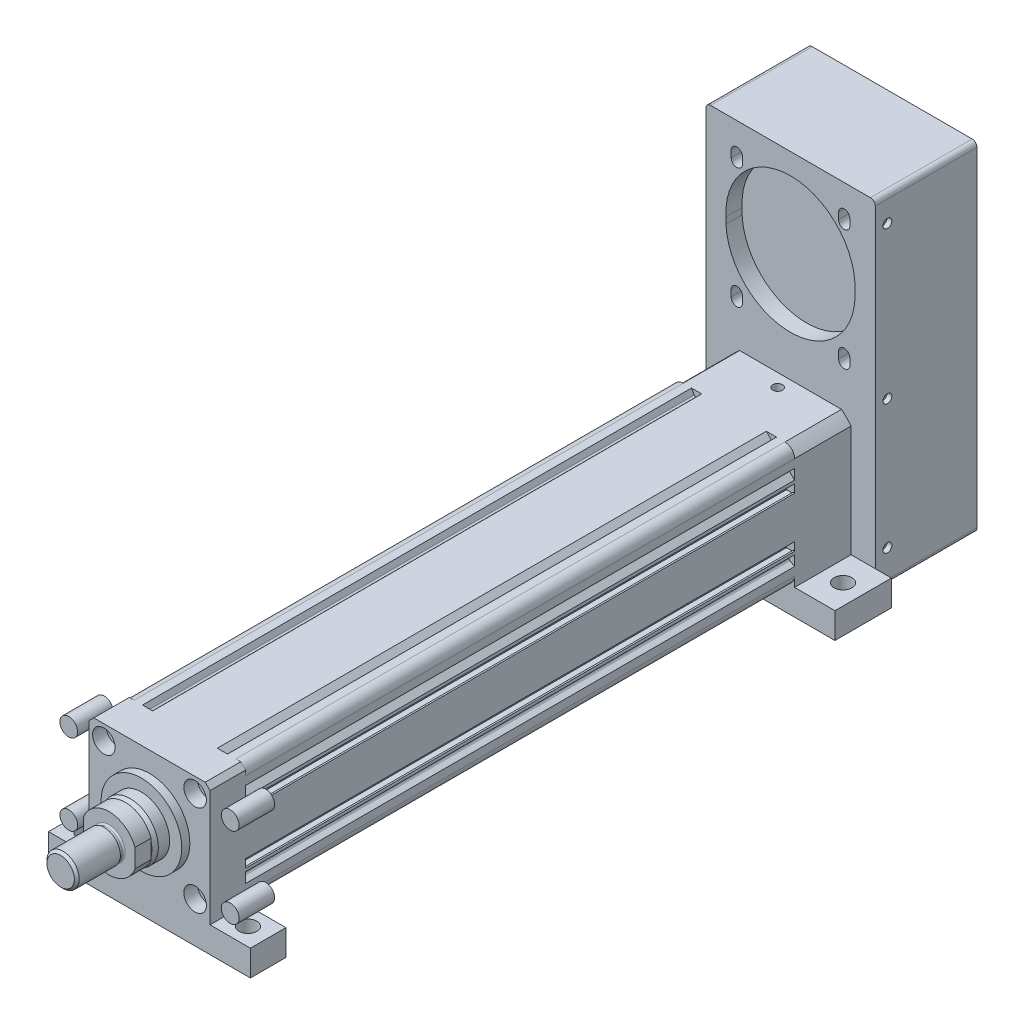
from build123d import *

# Parameters (mm, degrees)
SKETCH_1_R           = 31.5
SKETCH_1_R_2         = 3.35
EXTRUDE_1_DEPTH      = 340
SKETCH_2_R           = 5.5
EXTRUDE_1_2_DEPTH    = 22
EXTRUDE_1_2_2_DEPTH  = 22
EXTRUDE_1_2_3_DEPTH  = 22
EXTRUDE_1_2_4_DEPTH  = 22
SKETCH_2_R_2         = 4.25
EXTRUDE_1_2_5_DEPTH  = 22
SKETCH_3_R           = 7
SKETCH_3_R_2         = 4.25
CUT_EXTRUDE_1_DEPTH  = 8.5
SKETCH_3_3_R         = 25
EXTRUDE_2_DEPTH      = 5
SKETCH_5_R           = 17.5
EXTRUDE_3_DEPTH      = 10
CHAMFER_1_SIZE       = 3
CHAMFER_1_SIZE2      = 1
EXTRUDE_4_DEPTH      = 10
SKETCH_8_R           = 9
EXTRUDE_5_DEPTH      = 3
SKETCH_9_R           = 10
EXTRUDE_6_DEPTH      = 27
CHAMFER_2_SIZE       = 1.5
FILLET_1_R           = 1
EXTRUDE_7_DEPTH      = 35
SKETCH_11_R          = 3
CUT_EXTRUDE_2_DEPTH  = 5
SKETCH_18_W          = 105
SKETCH_18_H          = 210
EXTRUDE_11_DEPTH     = 63
CUT_EXTRUDE_7_DEPTH  = 10
CUT_EXTRUDE_START    = -10
CUT_EXTRUDE_9_DEPTH  = 5
SKETCH_21_R          = 2.75
CUT_EXTRUDE_10_DEPTH = 3
SKETCH_22_R          = 2.75
CUT_EXTRUDE_11_DEPTH = 3
SKETCH_23_W          = 125
SKETCH_23_H          = 35
SKETCH_23_R          = 5.5
SKETCH_23_H_2        = 22
EXTRUDE_12_DEPTH     = 16
FILLET_2_R           = 3
CUT_EXTRUDE_12_DEPTH = 22
CHAMFER_3_SIZE       = 3


with BuildPart() as part:
    # Sketch 1 → Extrude 1 (new body)
    with BuildSketch(Plane.XY):
        with BuildLine():
            Line((-31.5, 37.5), (-26.33, 37.5))
            Line((-26.33, 37.5), (-24.66467188, 34.615567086))
            ThreePointArc((-24.66467188, 34.615567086), (-23.929172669, 34.124122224), (-23.091539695, 34.408460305))
            Line((-23.091539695, 34.408460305), (-20, 37.5))
            Line((-20, 37.5), (20, 37.5))
            Line((20, 37.5), (23.091539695, 34.408460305))
            ThreePointArc((23.091539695, 34.408460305), (23.929172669, 34.124122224), (24.66467188, 34.615567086))
            Line((24.66467188, 34.615567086), (26.33, 37.5))
            Line((26.33, 37.5), (31.5, 37.5))
            ThreePointArc((31.5, 37.5), (35.742640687, 35.742640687), (37.5, 31.5))
            Line((37.5, 31.5), (37.5, 26.33))
            Line((37.5, 26.33), (34.615567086, 24.66467188))
            ThreePointArc((34.615567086, 24.66467188), (34.124122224, 23.929172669), (34.408460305, 23.091539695))
            Line((34.408460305, 23.091539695), (37.5, 20))
            Line((37.5, 20), (37.5, 18.1))
            Line((37.5, 18.1), (36.5, 18.1))
            Line((36.5, 18.1), (36.5, 18.7))
            Line((36.5, 18.7), (32.5, 18.7))
            Line((32.5, 18.7), (32.5, 12.4))
            Line((32.5, 12.4), (36.5, 12.4))
            Line((36.5, 12.4), (36.5, 13))
            Line((36.5, 13), (37.5, 13))
            Line((37.5, 13), (37.5, -13))
            Line((37.5, -13), (36.5, -13))
            Line((36.5, -13), (36.5, -12.4))
            Line((36.5, -12.4), (32.5, -12.4))
            Line((32.5, -12.4), (32.5, -18.7))
            Line((32.5, -18.7), (36.5, -18.7))
            Line((36.5, -18.7), (36.5, -18.1))
            Line((36.5, -18.1), (37.5, -18.1))
            Line((37.5, -18.1), (37.5, -20))
            Line((37.5, -20), (34.408460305, -23.091539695))
            ThreePointArc((34.408460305, -23.091539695), (34.124122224, -23.929172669), (34.615567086, -24.66467188))
            Line((34.615567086, -24.66467188), (37.5, -26.33))
            Line((37.5, -26.33), (37.5, -31.5))
            ThreePointArc((37.5, -31.5), (35.742640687, -35.742640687), (31.5, -37.5))
            Line((31.5, -37.5), (26.33, -37.5))
            Line((26.33, -37.5), (24.66467188, -34.615567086))
            ThreePointArc((24.66467188, -34.615567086), (23.929172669, -34.124122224), (23.091539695, -34.408460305))
            Line((23.091539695, -34.408460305), (20, -37.5))
            Line((20, -37.5), (18.1, -37.5))
            Line((18.1, -37.5), (18.1, -36.5))
            Line((18.1, -36.5), (18.7, -36.5))
            Line((18.7, -36.5), (18.7, -33.945032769))
            Line((18.7, -33.945032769), (12.4, -33.945032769))
            Line((12.4, -33.945032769), (12.4, -36.5))
            Line((12.4, -36.5), (13, -36.5))
            Line((13, -36.5), (13, -37.5))
            Line((13, -37.5), (-13, -37.5))
            Line((-13, -37.5), (-13, -36.5))
            Line((-13, -36.5), (-12.4, -36.5))
            Line((-12.4, -36.5), (-12.4, -33.945032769))
            Line((-12.4, -33.945032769), (-18.7, -33.945032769))
            Line((-18.7, -33.945032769), (-18.7, -36.5))
            Line((-18.7, -36.5), (-18.1, -36.5))
            Line((-18.1, -36.5), (-18.1, -37.5))
            Line((-18.1, -37.5), (-20, -37.5))
            Line((-20, -37.5), (-23.091539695, -34.408460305))
            ThreePointArc((-23.091539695, -34.408460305), (-23.929172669, -34.124122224), (-24.66467188, -34.615567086))
            Line((-24.66467188, -34.615567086), (-26.33, -37.5))
            Line((-26.33, -37.5), (-31.5, -37.5))
            ThreePointArc((-31.5, -37.5), (-35.742640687, -35.742640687), (-37.5, -31.5))
            Line((-37.5, -31.5), (-37.5, -26.33))
            Line((-37.5, -26.33), (-34.615567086, -24.66467188))
            ThreePointArc((-34.615567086, -24.66467188), (-34.124122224, -23.929172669), (-34.408460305, -23.091539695))
            Line((-34.408460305, -23.091539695), (-37.5, -20))
            Line((-37.5, -20), (-37.5, -18.1))
            Line((-37.5, -18.1), (-36.5, -18.1))
            Line((-36.5, -18.1), (-36.5, -18.7))
            Line((-36.5, -18.7), (-32.5, -18.7))
            Line((-32.5, -18.7), (-32.5, -12.4))
            Line((-32.5, -12.4), (-36.5, -12.4))
            Line((-36.5, -12.4), (-36.5, -13))
            Line((-36.5, -13), (-37.5, -13))
            Line((-37.5, -13), (-37.5, 13))
            Line((-37.5, 13), (-36.5, 13))
            Line((-36.5, 13), (-36.5, 12.4))
            Line((-36.5, 12.4), (-32.5, 12.4))
            Line((-32.5, 12.4), (-32.5, 18.7))
            Line((-32.5, 18.7), (-36.5, 18.7))
            Line((-36.5, 18.7), (-36.5, 18.1))
            Line((-36.5, 18.1), (-37.5, 18.1))
            Line((-37.5, 18.1), (-37.5, 20))
            Line((-37.5, 20), (-34.408460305, 23.091539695))
            ThreePointArc((-34.408460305, 23.091539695), (-34.124122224, 23.929172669), (-34.615567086, 24.66467188))
            Line((-34.615567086, 24.66467188), (-37.5, 26.33))
            Line((-37.5, 26.33), (-37.5, 31.5))
            ThreePointArc((-37.5, 31.5), (-35.742640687, 35.742640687), (-31.5, 37.5))
        make_face()
        Circle(SKETCH_1_R, mode=Mode.SUBTRACT)
        with Locations((-28.25, 28.25)):
            Circle(SKETCH_1_R_2, mode=Mode.SUBTRACT)
        with Locations(Location((28.25, 28.25, 0), (0, 0, 180))):
            Circle(SKETCH_1_R_2, mode=Mode.SUBTRACT)
        with Locations((28.25, -28.25)):
            Circle(SKETCH_1_R_2, mode=Mode.SUBTRACT)
        with Locations(Location((-28.25, -28.25, 0), (0, 0, 180))):
            Circle(SKETCH_1_R_2, mode=Mode.SUBTRACT)
    extrude(amount=EXTRUDE_1_DEPTH)



with BuildPart() as body_2:
    # Sketch 2 → Extrude 1 2 (new body)
    with BuildSketch(Plane.XY.offset(340)):
        with Locations((-50, 25)):
            Circle(SKETCH_2_R)
    extrude(amount=EXTRUDE_1_2_DEPTH)


with BuildPart() as body_3:
    # Sketch 2 → Extrude 1 2 2 (new body)
    with BuildSketch(Plane.XY.offset(340)):
        with Locations(Location((50, 25, 0), (0, 0, 180))):
            Circle(SKETCH_2_R)
    extrude(amount=EXTRUDE_1_2_2_DEPTH)


with BuildPart() as body_4:
    # Sketch 2 → Extrude 1 2 3 (new body)
    with BuildSketch(Plane.XY.offset(340)):
        with Locations(Location((-50, -25, 0), (0, 0, 180))):
            Circle(SKETCH_2_R)
    extrude(amount=EXTRUDE_1_2_3_DEPTH)


with BuildPart() as body_5:
    # Sketch 2 → Extrude 1 2 4 (new body)
    with BuildSketch(Plane.XY.offset(340)):
        with Locations((50, -25)):
            Circle(SKETCH_2_R)
    extrude(amount=EXTRUDE_1_2_4_DEPTH)


with BuildPart() as body_6:
    # Sketch 2 → Extrude 1 2 5 (new body)
    with BuildSketch(Plane.XY.offset(340)):
        Polygon((-40, 37), (-37, 40), (37, 40), (40, 37), (40, -37), (40, -40), (37, -40), (-37, -40), (-40, -40), (-40, -37), align=None)
        with Locations((-28.25, 28.25)):
            Circle(SKETCH_2_R_2, mode=Mode.SUBTRACT)
        with Locations(Location((28.25, 28.25, 0), (0, 0, 180))):
            Circle(SKETCH_2_R_2, mode=Mode.SUBTRACT)
        with Locations(Location((-28.25, -28.25, 0), (0, 0, 180))):
            Circle(SKETCH_2_R_2, mode=Mode.SUBTRACT)
        with Locations((28.25, -28.25)):
            Circle(SKETCH_2_R_2, mode=Mode.SUBTRACT)
    extrude(amount=EXTRUDE_1_2_5_DEPTH)

    # Sketch 3 → Cut-Extrude 1 (cut)
    # profile 1 of 4: a face of its own
    with BuildSketch(Plane.XY.offset(362)):
        with Locations((28.25, -28.25)):
            Circle(SKETCH_3_R)
        with Locations((28.25, -28.25)):
            Circle(SKETCH_3_R_2, mode=Mode.SUBTRACT)
    # profile 2 of 4: a face of its own
    with BuildSketch(Plane.XY.offset(362)):
        with Locations((-28.25, -28.25)):
            Circle(SKETCH_3_R)
        with Locations(Location((-28.25, -28.25, 0), (0, 0, 180))):
            Circle(SKETCH_3_R_2, mode=Mode.SUBTRACT)
    # profile 3 of 4: a face of its own
    with BuildSketch(Plane.XY.offset(362)):
        with Locations((-28.25, 28.25)):
            Circle(SKETCH_3_R)
    # profile 4 of 4: a face of its own
    with BuildSketch(Plane.XY.offset(362)):
        with Locations((28.25, 28.25)):
            Circle(SKETCH_3_R)
    extrude(amount=-CUT_EXTRUDE_1_DEPTH, mode=Mode.SUBTRACT)

    # Sketch 3_3 → Extrude 2 (add)
    with BuildSketch(Plane.XY.offset(362)):
        Circle(SKETCH_3_3_R)
    extrude(amount=EXTRUDE_2_DEPTH)

    # Sketch 5 → Extrude 3 (add)
    with BuildSketch(Plane.XY.offset(367)):
        Circle(SKETCH_5_R)
    extrude(amount=EXTRUDE_3_DEPTH)

    # Chamfer 1
    chamfer_1_edges = [body_6.edges().sort_by_distance(p)[0] for p in [
        (-17.5, 0, 377),
    ]]
    chamfer_1_side = [body_6.faces().sort_by_distance(p)[0] for p in [
        (-17.5, 0, 372),
    ]]
    chamfer(chamfer_1_edges, length=CHAMFER_1_SIZE, length2=CHAMFER_1_SIZE2, reference=chamfer_1_side[0])

    # Sketch 6 → Extrude 4 (add)
    with BuildSketch(Plane.XY.offset(377)):
        with BuildLine():
            Line((-16, 5.744562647), (-16, -5.744562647))
            ThreePointArc((-16, -5.744562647), (0, -17), (16, -5.744562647))
            Line((16, -5.744562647), (16, 5.744562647))
            ThreePointArc((16, 5.744562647), (0, 17), (-16, 5.744562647))
        make_face()
    extrude(amount=EXTRUDE_4_DEPTH)

    # Sketch 8 → Extrude 5 (add)
    with BuildSketch(Plane.XY.offset(387)):
        Circle(SKETCH_8_R)
    extrude(amount=EXTRUDE_5_DEPTH)

    # Sketch 9 → Extrude 6 (add)
    with BuildSketch(Plane.XY.offset(390)):
        Circle(SKETCH_9_R)
    extrude(amount=EXTRUDE_6_DEPTH)

    # Chamfer 2
    chamfer_2_edges = [body_6.edges().sort_by_distance(p)[0] for p in [
        (-10, 0, 417),
    ]]
    chamfer(chamfer_2_edges, length=CHAMFER_2_SIZE)

    # Fillet 1
    fillet_1_edges = [body_6.edges().sort_by_distance(p)[0] for p in [
        (-9, 0, 387),
    ]]
    fillet(fillet_1_edges, radius=FILLET_1_R)


with BuildPart() as body_7:
    # Sketch 10 → Extrude 7 (new body)
    with BuildSketch(Plane(origin=(0, 0, 0), x_dir=(-1, 0, 0), z_dir=(0, 0, -1))):
        with BuildLine():
            Line((37.5, -31.539657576), (37.5, -37.5))
            Line((37.5, -37.5), (31.539657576, -37.5))
            Line((31.539657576, -37.5), (-31.539657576, -37.5))
            Line((-31.539657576, -37.5), (-37.5, -37.5))
            Line((-37.5, -37.5), (-37.5, -31.539657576))
            Line((-37.5, -31.539657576), (-37.5, 31.539657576))
            ThreePointArc((-37.5, 31.539657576), (-34.648232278, 34.648232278), (-31.539657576, 37.5))
            Line((-31.539657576, 37.5), (31.539657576, 37.5))
            ThreePointArc((31.539657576, 37.5), (34.648232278, 34.648232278), (37.5, 31.539657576))
            Line((37.5, 31.539657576), (37.5, -31.539657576))
        make_face()
    extrude(amount=EXTRUDE_7_DEPTH)

    # Sketch 11 → Cut-Extrude 2 (cut)
    with BuildSketch(Plane(origin=(0, 37.5, 0), x_dir=(1, 0, 0), z_dir=(0, 1, 0))):
        with Locations(Location((0, 27, 0), (0, 0, 270))):
            Circle(SKETCH_11_R)
    extrude(amount=-CUT_EXTRUDE_2_DEPTH, mode=Mode.SUBTRACT)

    # Sketch 18 → Extrude 11 (add)
    with BuildSketch(Plane(origin=(0, 0, -35), x_dir=(-1, 0, 0), z_dir=(0, 0, -1))):
        with Locations((0, 55)):
            Rectangle(SKETCH_18_W, SKETCH_18_H)
    extrude(amount=EXTRUDE_11_DEPTH)

    # Sketch 19 → Cut-Extrude 7 (cut)
    with BuildSketch(Plane.XY.offset(-35)):
        with BuildLine():
            Line((-40, 105), (-40, 101))
            ThreePointArc((-40, 101), (-0.049906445, 62.997504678), (39.90018711, 101))
            Line((39.90018711, 101), (39.90018711, 105))
            ThreePointArc((39.90018711, 105), (-0.049906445, 146.997504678), (-40, 105))
        make_face()
        with BuildLine():
            Line((-36.761032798, 138.332341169), (-36.761032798, 142.332341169))
            ThreePointArc((-36.761032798, 142.332341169), (-33.261032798, 145.832341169), (-29.761032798, 142.332341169))
            Line((-29.761032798, 142.332341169), (-29.761032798, 138.332341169))
            ThreePointArc((-29.761032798, 138.332341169), (-33.261032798, 134.832341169), (-36.761032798, 138.332341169))
        make_face()
        with BuildLine():
            Line((36.761032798, 138.332341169), (36.761032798, 142.332341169))
            ThreePointArc((36.761032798, 142.332341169), (33.261032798, 145.832341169), (29.761032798, 142.332341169))
            Line((29.761032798, 142.332341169), (29.761032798, 138.332341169))
            ThreePointArc((29.761032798, 138.332341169), (33.261032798, 134.832341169), (36.761032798, 138.332341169))
        make_face()
        with BuildLine():
            Line((36.761032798, 67.667658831), (36.761032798, 63.667658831))
            ThreePointArc((36.761032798, 63.667658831), (33.261032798, 60.167658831), (29.761032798, 63.667658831))
            Line((29.761032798, 63.667658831), (29.761032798, 67.667658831))
            ThreePointArc((29.761032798, 67.667658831), (33.261032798, 71.167658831), (36.761032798, 67.667658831))
        make_face()
        with BuildLine():
            Line((-36.761032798, 67.667658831), (-36.761032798, 63.667658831))
            ThreePointArc((-36.761032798, 63.667658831), (-33.261032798, 60.167658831), (-29.761032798, 63.667658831))
            Line((-29.761032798, 63.667658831), (-29.761032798, 67.667658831))
            ThreePointArc((-29.761032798, 67.667658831), (-33.261032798, 71.167658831), (-36.761032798, 67.667658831))
        make_face()
    extrude(amount=-CUT_EXTRUDE_7_DEPTH, mode=Mode.SUBTRACT)

    # Sketch 19_3 → Cut-Extrude 9 (cut)
    with BuildSketch(Plane.XY.offset(-35).offset(CUT_EXTRUDE_START)):
        with BuildLine():
            Line((-38.461032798, 138.282341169), (-38.461032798, 142.382341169))
            ThreePointArc((-38.461032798, 142.382341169), (-33.261032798, 147.582341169), (-28.061032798, 142.382341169))
            Line((-28.061032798, 142.382341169), (-28.061032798, 138.282341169))
            ThreePointArc((-28.061032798, 138.282341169), (-33.261032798, 133.082341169), (-38.461032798, 138.282341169))
        make_face()
        with BuildLine():
            Line((38.461032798, 138.282341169), (38.461032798, 142.382341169))
            ThreePointArc((38.461032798, 142.382341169), (33.261032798, 147.582341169), (28.061032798, 142.382341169))
            Line((28.061032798, 142.382341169), (28.061032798, 138.282341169))
            ThreePointArc((28.061032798, 138.282341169), (33.261032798, 133.082341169), (38.461032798, 138.282341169))
        make_face()
        with BuildLine():
            Line((38.461032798, 67.717658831), (38.461032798, 63.617658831))
            ThreePointArc((38.461032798, 63.617658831), (33.261032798, 58.417658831), (28.061032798, 63.617658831))
            Line((28.061032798, 63.617658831), (28.061032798, 67.717658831))
            ThreePointArc((28.061032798, 67.717658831), (33.261032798, 72.917658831), (38.461032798, 67.717658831))
        make_face()
        with BuildLine():
            Line((-38.461032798, 67.717658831), (-38.461032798, 63.617658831))
            ThreePointArc((-38.461032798, 63.617658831), (-33.261032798, 58.417658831), (-28.061032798, 63.617658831))
            Line((-28.061032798, 63.617658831), (-28.061032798, 67.717658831))
            ThreePointArc((-28.061032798, 67.717658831), (-33.261032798, 72.917658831), (-38.461032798, 67.717658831))
        make_face()
    extrude(amount=-CUT_EXTRUDE_9_DEPTH, mode=Mode.SUBTRACT)

    # Sketch 21 → Cut-Extrude 10 (cut)
    with BuildSketch(Plane.ZY.offset(52.5)):
        with Locations(Location((-42.5, -30, 0), (0, 0, 270))):
            Circle(SKETCH_21_R)
        with Locations(Location((-42.5, 55, 0), (0, 0, 270))):
            Circle(SKETCH_21_R)
        with Locations(Location((-42.5, 149, 0), (0, 0, 270))):
            Circle(SKETCH_21_R)
    extrude(amount=-CUT_EXTRUDE_10_DEPTH, mode=Mode.SUBTRACT)

    # Sketch 22 → Cut-Extrude 11 (cut)
    with BuildSketch(Plane(origin=(52.5, 0, 0), x_dir=(0, 0, -1), z_dir=(1, 0, 0))):
        with Locations(Location((42.5, -30, 0), (0, 0, 270))):
            Circle(SKETCH_22_R)
        with Locations(Location((42.5, 50, 0), (0, 0, 90))):
            Circle(SKETCH_22_R)
        with Locations(Location((42.5, 144, 0), (0, 0, 90))):
            Circle(SKETCH_22_R)
    extrude(amount=-CUT_EXTRUDE_11_DEPTH, mode=Mode.SUBTRACT)


with BuildPart() as part_1:
    add(part.part)

    add(body_6.part)  # Extrude 12 merges body 6

    add(body_7.part)  # Extrude 12 merges body 7
    # Sketch 23 → Extrude 12 (add)
    # profile 1 of 2: a face of its own
    with BuildSketch(Plane.XZ.offset(37.5)):
        with Locations((0, -17.5)):
            Rectangle(SKETCH_23_W, SKETCH_23_H)
        with Locations(Location((-50, -17.5, 0), (0, 0, 270))):
            Circle(SKETCH_23_R, mode=Mode.SUBTRACT)
        with Locations(Location((50, -17.5, 0), (0, 0, 270))):
            Circle(SKETCH_23_R, mode=Mode.SUBTRACT)
    # profile 2 of 2: a face of its own
    with BuildSketch(Plane.XZ.offset(37.5)):
        with Locations((0, 351)):
            Rectangle(SKETCH_23_W, SKETCH_23_H_2)
        with Locations(Location((-50, 351, 0), (0, 0, 270))):
            Circle(SKETCH_23_R, mode=Mode.SUBTRACT)
        with Locations(Location((50, 351, 0), (0, 0, 270))):
            Circle(SKETCH_23_R, mode=Mode.SUBTRACT)
    extrude(amount=EXTRUDE_12_DEPTH)

    # Fillet 2
    fillet_2_edges = [part_1.edges().sort_by_distance(p)[0] for p in [
        (-52.5, -50, -66.5),
        (-52.5, 160, -66.5),
        (52.5, 160, -66.5),
        (52.5, -50, -66.5),
    ]]
    fillet(fillet_2_edges, radius=FILLET_2_R)

    # Sketch 24 → Cut-Extrude 12 (cut)
    with BuildSketch(Plane.XY.offset(362)):
        Polygon((-43.856876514, -37.5), (-37.5, -37.5), (-37.5, 37.5), (37.5, 37.5), (37.5, -37.5), (45, -37.5), (45, 49.514071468), (-52.5, 47.392362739), align=None)
    extrude(amount=-CUT_EXTRUDE_12_DEPTH, mode=Mode.SUBTRACT)

    # Chamfer 3
    chamfer_3_edges = [part_1.edges().sort_by_distance(p)[0] for p in [
        (37.5, 37.5, 351),
        (-37.5, 37.5, 351),
    ]]
    chamfer(chamfer_3_edges, length=CHAMFER_3_SIZE)


solid = Compound([body_2.part, body_3.part, body_4.part, body_5.part, part_1.part])
